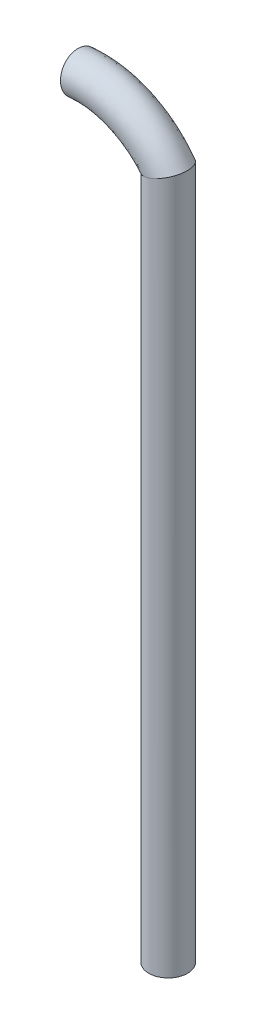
ISO-10303-21;
HEADER;
FILE_DESCRIPTION(('STEP AP214'),'2;1');
FILE_NAME('part.step','',(''),(''),'','','');
FILE_SCHEMA(('AUTOMOTIVE_DESIGN { 1 0 10303 214 1 1 1 1 }'));
ENDSEC;
DATA;
#1=APPLICATION_CONTEXT('core data for automotive mechanical design processes');
#2=APPLICATION_PROTOCOL_DEFINITION('international standard','automotive_design',2000,#1);
#3=PRODUCT_CONTEXT('',#1,'mechanical');
#4=PRODUCT('Part','Part','',(#3));
#5=PRODUCT_RELATED_PRODUCT_CATEGORY('part','',(#4));
#6=PRODUCT_DEFINITION_FORMATION('','',#4);
#7=PRODUCT_DEFINITION_CONTEXT('part definition',#1,'design');
#8=PRODUCT_DEFINITION('design','',#6,#7);
#9=PRODUCT_DEFINITION_SHAPE('','',#8);
#10=(LENGTH_UNIT() NAMED_UNIT(*) SI_UNIT(.MILLI.,.METRE.));
#11=(NAMED_UNIT(*) PLANE_ANGLE_UNIT() SI_UNIT($,.RADIAN.));
#12=(NAMED_UNIT(*) SI_UNIT($,.STERADIAN.) SOLID_ANGLE_UNIT());
#13=UNCERTAINTY_MEASURE_WITH_UNIT(LENGTH_MEASURE(1.E-05),#10,'distance_accuracy_value','');
#14=(GEOMETRIC_REPRESENTATION_CONTEXT(3) GLOBAL_UNCERTAINTY_ASSIGNED_CONTEXT((#13)) GLOBAL_UNIT_ASSIGNED_CONTEXT((#10,
#11,#12)) REPRESENTATION_CONTEXT('',''));
#15=CARTESIAN_POINT('',(0.,0.,0.));
#16=DIRECTION('',(0.,0.,1.));
#17=DIRECTION('',(1.,0.,0.));
#18=AXIS2_PLACEMENT_3D('',#15,#16,#17);
#19=CARTESIAN_POINT('',(0.,178.,0.));
#20=DIRECTION('',(0.,-1.,0.));
#21=DIRECTION('',(0.,0.,-1.));
#22=AXIS2_PLACEMENT_3D('',#19,#20,#21);
#23=CYLINDRICAL_SURFACE('',#22,5.);
#24=CARTESIAN_POINT('',(0.,0.,0.));
#25=DIRECTION('',(0.,1.,0.));
#26=DIRECTION('',(0.,0.,1.));
#27=AXIS2_PLACEMENT_3D('',#24,#25,#26);
#28=CIRCLE('',#27,5.);
#29=CARTESIAN_POINT('',(0.,0.,5.));
#30=VERTEX_POINT('',#29);
#31=EDGE_CURVE('E12',#30,#30,#28,.T.);
#32=ORIENTED_EDGE('',*,*,#31,.T.);
#33=EDGE_LOOP('',(#32));
#34=FACE_BOUND('',#33,.T.);
#35=CARTESIAN_POINT('',(0.,178.,5.00000000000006));
#36=CARTESIAN_POINT('',(-0.00574009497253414,177.998064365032,5.00000001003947));
#37=CARTESIAN_POINT('',(-0.011480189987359,177.996128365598,4.9999901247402));
#38=CARTESIAN_POINT('',(-0.164519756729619,177.944501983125,4.99946279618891));
#39=CARTESIAN_POINT('',(-0.311795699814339,177.89457968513,4.99244034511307));
#40=CARTESIAN_POINT('',(-0.605194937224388,177.794631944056,4.96542730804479));
#41=CARTESIAN_POINT('',(-0.751317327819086,177.74460645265,4.94542741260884));
#42=CARTESIAN_POINT('',(-1.04167101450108,177.644709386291,4.892519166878));
#43=CARTESIAN_POINT('',(-1.18589700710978,177.594838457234,4.8595803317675));
#44=CARTESIAN_POINT('',(-1.4711221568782,177.495721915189,4.78097199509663));
#45=CARTESIAN_POINT('',(-1.61212005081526,177.446476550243,4.7352975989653));
#46=CARTESIAN_POINT('',(-1.88973482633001,177.34903913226,4.63150614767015));
#47=CARTESIAN_POINT('',(-2.02635421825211,177.300846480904,4.57339637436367));
#48=CARTESIAN_POINT('',(-2.29433354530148,177.20586089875,4.44501020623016));
#49=CARTESIAN_POINT('',(-2.4256914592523,177.159068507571,4.37472919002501));
#50=CARTESIAN_POINT('',(-2.68196689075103,177.067350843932,4.22246955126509));
#51=CARTESIAN_POINT('',(-2.80688987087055,177.022423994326,4.14050108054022));
#52=CARTESIAN_POINT('',(-3.04940048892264,176.93481732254,3.96529087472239));
#53=CARTESIAN_POINT('',(-3.16698852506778,176.892137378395,3.87204975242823));
#54=CARTESIAN_POINT('',(-3.39137411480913,176.810348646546,3.6769826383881));
#55=CARTESIAN_POINT('',(-3.4983500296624,176.77118258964,3.57538591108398));
#56=CARTESIAN_POINT('',(-3.70333713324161,176.695842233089,3.36260385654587));
#57=CARTESIAN_POINT('',(-3.80135313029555,176.659666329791,3.25142373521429));
#58=CARTESIAN_POINT('',(-3.98760757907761,176.590680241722,3.02010646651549));
#59=CARTESIAN_POINT('',(-4.07584249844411,176.557871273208,2.89996610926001));
#60=CARTESIAN_POINT('',(-4.24157874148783,176.496050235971,2.65165562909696));
#61=CARTESIAN_POINT('',(-4.31908533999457,176.46703630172,2.5234894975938));
#62=CARTESIAN_POINT('',(-4.45849761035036,176.414706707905,2.26755532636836));
#63=CARTESIAN_POINT('',(-4.52104097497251,176.391160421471,2.14018155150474));
#64=CARTESIAN_POINT('',(-4.63525006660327,176.348070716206,1.88005903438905));
#65=CARTESIAN_POINT('',(-4.68692077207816,176.328525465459,1.7473127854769));
#66=CARTESIAN_POINT('',(-4.778868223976,176.293686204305,1.47741025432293));
#67=CARTESIAN_POINT('',(-4.81914674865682,176.278391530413,1.34025466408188));
#68=CARTESIAN_POINT('',(-4.88787692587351,176.252261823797,1.06259601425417));
#69=CARTESIAN_POINT('',(-4.91632911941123,176.241426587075,0.922093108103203));
#70=CARTESIAN_POINT('',(-4.95974251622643,176.224882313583,0.647391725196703));
#71=CARTESIAN_POINT('',(-4.9754106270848,176.218904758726,0.513320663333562));
#72=CARTESIAN_POINT('',(-4.99585761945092,176.211102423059,0.244181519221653));
#73=CARTESIAN_POINT('',(-5.0006328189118,176.209279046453,0.109113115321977));
#74=CARTESIAN_POINT('',(-4.99923316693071,176.209813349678,-0.160884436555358));
#75=CARTESIAN_POINT('',(-4.99306424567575,176.212168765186,-0.295813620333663));
#76=CARTESIAN_POINT('',(-4.96984746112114,176.221026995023,-0.564645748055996));
#77=CARTESIAN_POINT('',(-4.95279559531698,176.227531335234,-0.698548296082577));
#78=CARTESIAN_POINT('',(-4.90856984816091,176.24438120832,-0.9608141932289));
#79=CARTESIAN_POINT('',(-4.88167167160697,176.25462209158,-1.08923091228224));
#80=CARTESIAN_POINT('',(-4.81796451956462,176.278839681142,-1.34326939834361));
#81=CARTESIAN_POINT('',(-4.78115201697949,176.292817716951,-1.46889015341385));
#82=CARTESIAN_POINT('',(-4.69797273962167,176.324340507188,-1.71641891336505));
#83=CARTESIAN_POINT('',(-4.65160902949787,176.341884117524,-1.83832809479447));
#84=CARTESIAN_POINT('',(-4.54971362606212,176.380351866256,-2.07774920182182));
#85=CARTESIAN_POINT('',(-4.49417847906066,176.401277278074,-2.19525945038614));
#86=CARTESIAN_POINT('',(-4.37309893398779,176.44677937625,-2.42766160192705));
#87=CARTESIAN_POINT('',(-4.30736158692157,176.471426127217,-2.54243941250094));
#88=CARTESIAN_POINT('',(-4.16735940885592,176.523759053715,-2.76595997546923));
#89=CARTESIAN_POINT('',(-4.09309147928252,176.551446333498,-2.87470051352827));
#90=CARTESIAN_POINT('',(-3.85839266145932,176.638653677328,-3.19085615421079));
#91=CARTESIAN_POINT('',(-3.68595976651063,176.702359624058,-3.38840914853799));
#92=CARTESIAN_POINT('',(-3.30415770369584,176.842318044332,-3.76270762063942));
#93=CARTESIAN_POINT('',(-3.09328194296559,176.919066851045,-3.93771886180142));
#94=CARTESIAN_POINT('',(-2.64762581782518,177.079826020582,-4.25019772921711));
#95=CARTESIAN_POINT('',(-2.41282828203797,177.163841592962,-4.38763812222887));
#96=CARTESIAN_POINT('',(-1.9110050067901,177.341751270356,-4.62927532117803));
#97=CARTESIAN_POINT('',(-1.64289224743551,177.435935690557,-4.73099957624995));
#98=CARTESIAN_POINT('',(-1.09451636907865,177.626675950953,-4.88703527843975));
#99=CARTESIAN_POINT('',(-0.814274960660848,177.723227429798,-4.94142804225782));
#100=CARTESIAN_POINT('',(-0.36074963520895,177.877978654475,-4.98993209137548));
#101=CARTESIAN_POINT('',(-0.189013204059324,177.936239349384,-4.99937863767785));
#102=CARTESIAN_POINT('',(-0.0114802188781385,177.996128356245,-4.99999011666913));
#103=CARTESIAN_POINT('',(-0.00574012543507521,177.998064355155,-5.00000000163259));
#104=CARTESIAN_POINT('',(0.,177.999999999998,-5.));
#105=B_SPLINE_CURVE_WITH_KNOTS('',3,(#35,#36,#37,#38,#39,#40,#41,#42,#43,#44,#45,#46,#47,#48,
#49,#50,#51,#52,#53,#54,#55,#56,#57,#58,#59,#60,#61,#62,#63,#64,#65,#66,#67,#68,#69,#70,#71,#72,
#73,#74,#75,#76,#77,#78,#79,#80,#81,#82,#83,#84,#85,#86,#87,#88,#89,#90,#91,#92,#93,#94,#95,#96,
#97,#98,#99,#100,#101,#102,#103,#104),.UNSPECIFIED.,.F.,.F.,(4,2,2,2,2,2,2,2,2,2,2,2,2,2,2,2,2,
2,2,2,2,2,2,2,2,2,2,2,2,2,2,2,2,2,4),(0.,0.018173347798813,0.484531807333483,0.951225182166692,
1.41902477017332,1.88700439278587,2.354710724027,2.82259503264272,3.29007538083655,
3.75753032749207,4.21487606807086,4.67197491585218,5.12923830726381,5.58627606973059,
6.01724518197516,6.44801652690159,6.87872059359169,7.30940495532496,7.71425355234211,
8.11923897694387,8.52400502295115,8.92892001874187,9.32327025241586,9.71776096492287,
10.1121252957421,10.5066384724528,10.90981136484,11.3131311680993,12.1190776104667,
12.9692036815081,13.8199443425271,14.7214409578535,15.6213857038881,16.1652945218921,
16.183467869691),.UNSPECIFIED.);
#106=CARTESIAN_POINT('',(0.,178.,-5.));
#107=VERTEX_POINT('',#106);
#108=CARTESIAN_POINT('',(0.,178.,5.00000000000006));
#109=VERTEX_POINT('',#108);
#110=EDGE_CURVE('E58',#107,#109,#105,.F.);
#111=ORIENTED_EDGE('',*,*,#110,.F.);
#112=CARTESIAN_POINT('',(0.,178.,5.00000000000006));
#113=CARTESIAN_POINT('',(0.00574009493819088,178.001935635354,5.00000000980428));
#114=CARTESIAN_POINT('',(0.0114803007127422,178.003871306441,4.99999012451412));
#115=CARTESIAN_POINT('',(0.163474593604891,178.055125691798,4.99946639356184));
#116=CARTESIAN_POINT('',(0.309777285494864,178.104459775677,4.99253958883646));
#117=CARTESIAN_POINT('',(0.60139720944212,178.20279584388,4.96586194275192));
#118=CARTESIAN_POINT('',(0.746713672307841,178.251797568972,4.94610204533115));
#119=CARTESIAN_POINT('',(1.03562296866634,178.349219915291,4.89377987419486));
#120=CARTESIAN_POINT('',(1.17921099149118,178.397638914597,4.86118784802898));
#121=CARTESIAN_POINT('',(1.46332982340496,178.493445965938,4.78334314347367));
#122=CARTESIAN_POINT('',(1.60385945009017,178.540833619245,4.73808565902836));
#123=CARTESIAN_POINT('',(1.8807433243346,178.634200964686,4.63514982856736));
#124=CARTESIAN_POINT('',(2.017098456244,178.680180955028,4.57747413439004));
#125=CARTESIAN_POINT('',(2.28467465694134,178.770409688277,4.44997002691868));
#126=CARTESIAN_POINT('',(2.41589375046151,178.814657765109,4.38013699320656));
#127=CARTESIAN_POINT('',(2.67198309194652,178.901013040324,4.2287833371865));
#128=CARTESIAN_POINT('',(2.79685893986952,178.943122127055,4.14727327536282));
#129=CARTESIAN_POINT('',(3.03934283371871,179.024889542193,3.97299450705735));
#130=CARTESIAN_POINT('',(3.15695128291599,179.064548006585,3.88022642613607));
#131=CARTESIAN_POINT('',(3.3808135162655,179.140036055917,3.68665191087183));
#132=CARTESIAN_POINT('',(3.48728799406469,179.175940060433,3.58612976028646));
#133=CARTESIAN_POINT('',(3.69140360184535,179.244769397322,3.37565068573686));
#134=CARTESIAN_POINT('',(3.78904942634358,179.277696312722,3.26569883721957));
#135=CARTESIAN_POINT('',(3.97470749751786,179.340301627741,3.03700521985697));
#136=CARTESIAN_POINT('',(4.06271615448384,179.369978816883,2.91826020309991));
#137=CARTESIAN_POINT('',(4.2281691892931,179.425770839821,2.67291321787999));
#138=CARTESIAN_POINT('',(4.30561853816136,179.451887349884,2.54631498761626));
#139=CARTESIAN_POINT('',(4.44547294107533,179.499047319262,2.29294710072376));
#140=CARTESIAN_POINT('',(4.50845139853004,179.520284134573,2.16652967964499));
#141=CARTESIAN_POINT('',(4.62363132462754,179.559123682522,1.9084016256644));
#142=CARTESIAN_POINT('',(4.67583751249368,179.576728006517,1.77669334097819));
#143=CARTESIAN_POINT('',(4.76898820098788,179.608139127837,1.5089218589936));
#144=CARTESIAN_POINT('',(4.80993348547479,179.621946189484,1.37285896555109));
#145=CARTESIAN_POINT('',(4.88015057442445,179.645623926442,1.097418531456));
#146=CARTESIAN_POINT('',(4.90942274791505,179.655494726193,0.958041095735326));
#147=CARTESIAN_POINT('',(4.95489970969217,179.670829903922,0.683661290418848));
#148=CARTESIAN_POINT('',(4.9716523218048,179.676479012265,0.548759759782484));
#149=CARTESIAN_POINT('',(4.99412179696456,179.684055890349,0.277887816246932));
#150=CARTESIAN_POINT('',(4.99983489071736,179.685982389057,0.1419170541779));
#151=CARTESIAN_POINT('',(5.00015797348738,179.686091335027,-0.129970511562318));
#152=CARTESIAN_POINT('',(4.99477350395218,179.684275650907,-0.265887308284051));
#153=CARTESIAN_POINT('',(4.97296063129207,179.676920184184,-0.536780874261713));
#154=CARTESIAN_POINT('',(4.95652816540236,179.671379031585,-0.671757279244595));
#155=CARTESIAN_POINT('',(4.91319947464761,179.6567682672,-0.937119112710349));
#156=CARTESIAN_POINT('',(4.88651302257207,179.647769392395,-1.06754277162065));
#157=CARTESIAN_POINT('',(4.82290173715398,179.626319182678,-1.32562772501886));
#158=CARTESIAN_POINT('',(4.7859732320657,179.613866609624,-1.45328801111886));
#159=CARTESIAN_POINT('',(4.70222606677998,179.58562642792,-1.70488773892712));
#160=CARTESIAN_POINT('',(4.65541106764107,179.569840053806,-1.82882853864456));
#161=CARTESIAN_POINT('',(4.55227118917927,179.535060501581,-2.07227226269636));
#162=CARTESIAN_POINT('',(4.49594273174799,179.516066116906,-2.19177349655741));
#163=CARTESIAN_POINT('',(4.37333328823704,179.474721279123,-2.42731154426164));
#164=CARTESIAN_POINT('',(4.30691481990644,179.452324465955,-2.5432687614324));
#165=CARTESIAN_POINT('',(4.16532537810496,179.404579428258,-2.7690890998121));
#166=CARTESIAN_POINT('',(4.09015128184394,179.3792301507,-2.87895002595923));
#167=CARTESIAN_POINT('',(3.85240134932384,179.299059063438,-3.19832889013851));
#168=CARTESIAN_POINT('',(3.67749812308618,179.240080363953,-3.3978332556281));
#169=CARTESIAN_POINT('',(3.28188803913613,179.10667763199,-3.78322635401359));
#170=CARTESIAN_POINT('',(3.05837927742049,179.031308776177,-3.96589674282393));
#171=CARTESIAN_POINT('',(2.58539990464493,178.87181653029,-4.28926870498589));
#172=CARTESIAN_POINT('',(2.33590928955,178.787686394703,-4.42993761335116));
#173=CARTESIAN_POINT('',(1.81847533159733,178.613203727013,-4.66627525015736));
#174=CARTESIAN_POINT('',(1.55052670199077,178.52284941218,-4.76193102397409));
#175=CARTESIAN_POINT('',(1.00398501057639,178.338551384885,-4.90628859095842));
#176=CARTESIAN_POINT('',(0.725414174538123,178.244615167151,-4.95508337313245));
#177=CARTESIAN_POINT('',(0.302803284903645,178.102108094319,-4.99287343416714));
#178=CARTESIAN_POINT('',(0.160007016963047,178.053956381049,-4.99947868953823));
#179=CARTESIAN_POINT('',(0.011480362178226,178.00387132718,-4.99999011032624));
#180=CARTESIAN_POINT('',(0.00574015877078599,178.001935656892,-4.99999999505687));
#181=CARTESIAN_POINT('',(0.,177.999999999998,-5.));
#182=B_SPLINE_CURVE_WITH_KNOTS('',3,(#112,#113,#114,#115,#116,#117,#118,#119,#120,#121,#122,
#123,#124,#125,#126,#127,#128,#129,#130,#131,#132,#133,#134,#135,#136,#137,#138,#139,#140,#141,
#142,#143,#144,#145,#146,#147,#148,#149,#150,#151,#152,#153,#154,#155,#156,#157,#158,#159,#160,
#161,#162,#163,#164,#165,#166,#167,#168,#169,#170,#171,#172,#173,#174,#175,#176,#177,#178,#179,
#180,#181),.UNSPECIFIED.,.F.,.F.,(4,2,2,2,2,2,2,2,2,2,2,2,2,2,2,2,2,2,2,2,2,2,2,2,2,2,2,2,2,2,2,
2,2,2,4),(0.,0.0181733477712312,0.481203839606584,0.944561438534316,1.4089997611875,
1.87361455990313,2.33813024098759,2.80282284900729,3.26709782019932,3.73134700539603,
4.18307497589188,4.63456131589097,5.08621526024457,5.53765583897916,5.9655876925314,
6.39333167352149,6.82104587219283,7.24874654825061,7.65641495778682,8.06422253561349,
8.47182652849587,8.87958049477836,9.27940231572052,9.67936765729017,10.0791851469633,
10.4791533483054,10.8851631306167,11.2913181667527,12.1029834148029,12.9936976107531,
13.8851027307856,14.7767642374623,15.6666526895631,16.118709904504,16.1368832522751),.UNSPECIFIED.);
#183=EDGE_CURVE('E63',#107,#109,#182,.F.);
#184=ORIENTED_EDGE('',*,*,#183,.T.);
#185=EDGE_LOOP('',(#111,#184));
#186=FACE_BOUND('',#185,.T.);
#187=ADVANCED_FACE('F50',(#34,#186),#23,.T.);
#188=CARTESIAN_POINT('',(0.,0.,0.));
#189=DIRECTION('',(0.,1.,0.));
#190=DIRECTION('',(0.,0.,1.));
#191=AXIS2_PLACEMENT_3D('',#188,#189,#190);
#192=PLANE('',#191);
#193=CARTESIAN_POINT('',(0.,0.,0.));
#194=DIRECTION('',(0.,-1.,0.));
#195=DIRECTION('',(0.,0.,-1.));
#196=AXIS2_PLACEMENT_3D('',#193,#194,#195);
#197=CIRCLE('',#196,3.);
#198=CARTESIAN_POINT('',(0.,0.,-3.));
#199=VERTEX_POINT('',#198);
#200=EDGE_CURVE('E69',#199,#199,#197,.T.);
#201=ORIENTED_EDGE('',*,*,#200,.F.);
#202=EDGE_LOOP('',(#201));
#203=FACE_BOUND('',#202,.T.);
#204=ORIENTED_EDGE('',*,*,#31,.F.);
#205=EDGE_LOOP('',(#204));
#206=FACE_BOUND('',#205,.T.);
#207=ADVANCED_FACE('F114',(#203,#206),#192,.F.);
#208=CARTESIAN_POINT('',(0.,40.,0.));
#209=DIRECTION('',(0.,-1.,0.));
#210=DIRECTION('',(0.,0.,-1.));
#211=AXIS2_PLACEMENT_3D('',#208,#209,#210);
#212=CYLINDRICAL_SURFACE('',#211,3.);
#213=CARTESIAN_POINT('',(0.,40.,0.));
#214=DIRECTION('',(0.,-1.,0.));
#215=DIRECTION('',(0.,0.,-1.));
#216=AXIS2_PLACEMENT_3D('',#213,#214,#215);
#217=CIRCLE('',#216,3.);
#218=CARTESIAN_POINT('',(0.,40.,-3.));
#219=VERTEX_POINT('',#218);
#220=EDGE_CURVE('E53',#219,#219,#217,.T.);
#221=ORIENTED_EDGE('',*,*,#220,.F.);
#222=EDGE_LOOP('',(#221));
#223=FACE_BOUND('',#222,.T.);
#224=ORIENTED_EDGE('',*,*,#200,.T.);
#225=EDGE_LOOP('',(#224));
#226=FACE_BOUND('',#225,.T.);
#227=ADVANCED_FACE('F109',(#223,#226),#212,.F.);
#228=CARTESIAN_POINT('',(0.,40.,0.));
#229=DIRECTION('',(0.,-1.,0.));
#230=DIRECTION('',(0.,0.,-1.));
#231=AXIS2_PLACEMENT_3D('',#228,#229,#230);
#232=PLANE('',#231);
#233=ORIENTED_EDGE('',*,*,#220,.T.);
#234=EDGE_LOOP('',(#233));
#235=FACE_BOUND('',#234,.T.);
#236=ADVANCED_FACE('F97',(#235),#232,.T.);
#237=CARTESIAN_POINT('',(-22.8176418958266,187.858152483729,0.));
#238=DIRECTION('',(-0.994524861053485,-0.104500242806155,0.));
#239=DIRECTION('',(0.,0.,1.));
#240=AXIS2_PLACEMENT_3D('',#237,#238,#239);
#241=PLANE('',#240);
#242=CARTESIAN_POINT('',(-22.8176418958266,187.858152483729,0.));
#243=DIRECTION('',(-0.994524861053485,-0.104500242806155,0.));
#244=DIRECTION('',(0.,0.,1.));
#245=AXIS2_PLACEMENT_3D('',#242,#243,#244);
#246=CIRCLE('',#245,5.);
#247=CARTESIAN_POINT('',(-22.8176418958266,187.858152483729,5.));
#248=VERTEX_POINT('',#247);
#249=EDGE_CURVE('E67',#248,#248,#246,.T.);
#250=ORIENTED_EDGE('',*,*,#249,.T.);
#251=EDGE_LOOP('',(#250));
#252=FACE_BOUND('',#251,.T.);
#253=ADVANCED_FACE('F98',(#252),#241,.T.);
#254=CARTESIAN_POINT('',(2.30674172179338,174.96856712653,5.));
#255=CARTESIAN_POINT('',(1.92228476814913,175.473805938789,5.));
#256=CARTESIAN_POINT('',(1.53782781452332,175.979044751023,5.));
#257=CARTESIAN_POINT('',(0.961142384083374,176.736902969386,5.));
#258=CARTESIAN_POINT('',(0.768913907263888,176.989522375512,5.));
#259=CARTESIAN_POINT('',(0.480571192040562,177.368451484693,5.));
#260=CARTESIAN_POINT('',(0.384456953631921,177.494761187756,5.));
#261=CARTESIAN_POINT('',(0.240285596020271,177.684225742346,5.));
#262=CARTESIAN_POINT('',(0.192228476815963,177.747380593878,5.));
#263=CARTESIAN_POINT('',(0.0961142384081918,177.873690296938,5.));
#264=CARTESIAN_POINT('',(0.0480577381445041,177.936845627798,5.));
#265=CARTESIAN_POINT('',(-0.0409893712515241,178.05386558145,5.));
#266=CARTESIAN_POINT('',(-0.0821920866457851,178.107565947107,5.));
#267=CARTESIAN_POINT('',(-0.165024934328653,178.214630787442,5.));
#268=CARTESIAN_POINT('',(-0.206654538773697,178.267995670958,5.));
#269=CARTESIAN_POINT('',(-0.332179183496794,178.427583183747,5.));
#270=CARTESIAN_POINT('',(-0.41671007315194,178.533298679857,5.));
#271=CARTESIAN_POINT('',(-0.672815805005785,178.848380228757,5.));
#272=CARTESIAN_POINT('',(-0.846904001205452,179.055681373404,5.));
#273=CARTESIAN_POINT('',(-1.37896883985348,179.669032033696,5.));
#274=CARTESIAN_POINT('',(-1.74675036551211,180.066528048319,5.));
#275=CARTESIAN_POINT('',(-2.88711956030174,181.222459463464,5.));
#276=CARTESIAN_POINT('',(-3.69679248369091,181.94429160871,5.));
#277=CARTESIAN_POINT('',(-6.25410680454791,183.945651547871,5.));
#278=CARTESIAN_POINT('',(-8.12998959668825,185.059757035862,5.));
#279=CARTESIAN_POINT('',(-14.0919966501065,187.635587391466,5.));
#280=CARTESIAN_POINT('',(-18.5093449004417,188.310849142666,5.));
#281=CARTESIAN_POINT('',(-22.8176418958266,187.858152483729,5.));
#282=CARTESIAN_POINT('',(10.2647545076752,181.024145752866,5.));
#283=CARTESIAN_POINT('',(9.88029755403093,181.529384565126,5.));
#284=CARTESIAN_POINT('',(9.49584060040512,182.03462337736,5.));
#285=CARTESIAN_POINT('',(8.91915516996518,182.792481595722,5.));
#286=CARTESIAN_POINT('',(8.72692669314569,183.045101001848,5.));
#287=CARTESIAN_POINT('',(8.43858397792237,183.424030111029,5.));
#288=CARTESIAN_POINT('',(8.34246973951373,183.550339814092,5.));
#289=CARTESIAN_POINT('',(8.19829838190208,183.739804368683,5.));
#290=CARTESIAN_POINT('',(8.15024126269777,183.802959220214,5.));
#291=CARTESIAN_POINT('',(8.05412702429,183.929268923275,5.));
#292=CARTESIAN_POINT('',(8.01555156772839,183.979965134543,5.));
#293=CARTESIAN_POINT('',(7.90893684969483,184.120070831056,5.));
#294=CARTESIAN_POINT('',(7.84339067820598,184.205586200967,5.));
#295=CARTESIAN_POINT('',(7.72787498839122,184.35489495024,5.));
#296=CARTESIAN_POINT('',(7.66981984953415,184.429315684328,5.));
#297=CARTESIAN_POINT('',(7.49476772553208,184.651870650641,5.));
#298=CARTESIAN_POINT('',(7.37688400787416,184.799297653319,5.));
#299=CARTESIAN_POINT('',(7.01972822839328,185.238698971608,5.));
#300=CARTESIAN_POINT('',(6.77695113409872,185.527793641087,5.));
#301=CARTESIAN_POINT('',(6.03495277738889,186.383150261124,5.));
#302=CARTESIAN_POINT('',(5.52205797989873,186.937483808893,5.));
#303=CARTESIAN_POINT('',(3.93174039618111,188.549503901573,5.));
#304=CARTESIAN_POINT('',(2.80259985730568,189.556144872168,5.));
#305=CARTESIAN_POINT('',(-0.763738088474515,192.347168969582,5.));
#306=CARTESIAN_POINT('',(-3.37977630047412,193.900860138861,5.));
#307=CARTESIAN_POINT('',(-11.6941754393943,197.493019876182,5.));
#308=CARTESIAN_POINT('',(-17.8544493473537,198.434715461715,5.));
#309=CARTESIAN_POINT('',(-23.8626443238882,197.803401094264,5.));
#310=CARTESIAN_POINT('',(10.2647545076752,181.024145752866,-5.));
#311=CARTESIAN_POINT('',(9.88029755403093,181.529384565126,-5.));
#312=CARTESIAN_POINT('',(9.49584060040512,182.03462337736,-5.));
#313=CARTESIAN_POINT('',(8.91915516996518,182.792481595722,-5.));
#314=CARTESIAN_POINT('',(8.72692669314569,183.045101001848,-5.));
#315=CARTESIAN_POINT('',(8.43858397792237,183.424030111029,-5.));
#316=CARTESIAN_POINT('',(8.34246973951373,183.550339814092,-5.));
#317=CARTESIAN_POINT('',(8.19829838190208,183.739804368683,-5.));
#318=CARTESIAN_POINT('',(8.15024126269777,183.802959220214,-5.));
#319=CARTESIAN_POINT('',(8.05412702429,183.929268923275,-5.));
#320=CARTESIAN_POINT('',(8.01555156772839,183.979965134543,-5.));
#321=CARTESIAN_POINT('',(7.90893684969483,184.120070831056,-5.));
#322=CARTESIAN_POINT('',(7.84339067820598,184.205586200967,-5.));
#323=CARTESIAN_POINT('',(7.72787498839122,184.35489495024,-5.));
#324=CARTESIAN_POINT('',(7.66981984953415,184.429315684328,-5.));
#325=CARTESIAN_POINT('',(7.49476772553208,184.651870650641,-5.));
#326=CARTESIAN_POINT('',(7.37688400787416,184.799297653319,-5.));
#327=CARTESIAN_POINT('',(7.01972822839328,185.238698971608,-5.));
#328=CARTESIAN_POINT('',(6.77695113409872,185.527793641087,-5.));
#329=CARTESIAN_POINT('',(6.03495277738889,186.383150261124,-5.));
#330=CARTESIAN_POINT('',(5.52205797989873,186.937483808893,-5.));
#331=CARTESIAN_POINT('',(3.93174039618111,188.549503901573,-5.));
#332=CARTESIAN_POINT('',(2.80259985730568,189.556144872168,-5.));
#333=CARTESIAN_POINT('',(-0.763738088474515,192.347168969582,-5.));
#334=CARTESIAN_POINT('',(-3.37977630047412,193.900860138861,-5.));
#335=CARTESIAN_POINT('',(-11.6941754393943,197.493019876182,-5.));
#336=CARTESIAN_POINT('',(-17.8544493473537,198.434715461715,-5.));
#337=CARTESIAN_POINT('',(-23.8626443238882,197.803401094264,-5.));
#338=CARTESIAN_POINT('',(2.30674172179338,174.96856712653,-5.));
#339=CARTESIAN_POINT('',(1.92228476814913,175.473805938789,-5.));
#340=CARTESIAN_POINT('',(1.53782781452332,175.979044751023,-5.));
#341=CARTESIAN_POINT('',(0.961142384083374,176.736902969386,-5.));
#342=CARTESIAN_POINT('',(0.768913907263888,176.989522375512,-5.));
#343=CARTESIAN_POINT('',(0.480571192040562,177.368451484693,-5.));
#344=CARTESIAN_POINT('',(0.384456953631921,177.494761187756,-5.));
#345=CARTESIAN_POINT('',(0.240285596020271,177.684225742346,-5.));
#346=CARTESIAN_POINT('',(0.192228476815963,177.747380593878,-5.));
#347=CARTESIAN_POINT('',(0.0961142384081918,177.873690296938,-5.));
#348=CARTESIAN_POINT('',(0.0480577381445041,177.936845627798,-5.));
#349=CARTESIAN_POINT('',(-0.0409893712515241,178.05386558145,-5.));
#350=CARTESIAN_POINT('',(-0.0821920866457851,178.107565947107,-5.));
#351=CARTESIAN_POINT('',(-0.165024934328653,178.214630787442,-5.));
#352=CARTESIAN_POINT('',(-0.206654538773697,178.267995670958,-5.));
#353=CARTESIAN_POINT('',(-0.332179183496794,178.427583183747,-5.));
#354=CARTESIAN_POINT('',(-0.41671007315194,178.533298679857,-5.));
#355=CARTESIAN_POINT('',(-0.672815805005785,178.848380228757,-5.));
#356=CARTESIAN_POINT('',(-0.846904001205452,179.055681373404,-5.));
#357=CARTESIAN_POINT('',(-1.37896883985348,179.669032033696,-5.));
#358=CARTESIAN_POINT('',(-1.74675036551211,180.066528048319,-5.));
#359=CARTESIAN_POINT('',(-2.88711956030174,181.222459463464,-5.));
#360=CARTESIAN_POINT('',(-3.69679248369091,181.94429160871,-5.));
#361=CARTESIAN_POINT('',(-6.25410680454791,183.945651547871,-5.));
#362=CARTESIAN_POINT('',(-8.12998959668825,185.059757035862,-5.));
#363=CARTESIAN_POINT('',(-14.0919966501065,187.635587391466,-5.));
#364=CARTESIAN_POINT('',(-18.5093449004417,188.310849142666,-5.));
#365=CARTESIAN_POINT('',(-22.8176418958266,187.858152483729,-5.));
#366=CARTESIAN_POINT('',(-5.65127106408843,168.912988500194,-5.));
#367=CARTESIAN_POINT('',(-6.03572801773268,169.418227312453,-5.));
#368=CARTESIAN_POINT('',(-6.42018497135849,169.923466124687,-5.));
#369=CARTESIAN_POINT('',(-6.99687040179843,170.681324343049,-5.));
#370=CARTESIAN_POINT('',(-7.18909887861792,170.933943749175,-5.));
#371=CARTESIAN_POINT('',(-7.47744159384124,171.312872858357,-5.));
#372=CARTESIAN_POINT('',(-7.57355583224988,171.439182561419,-5.));
#373=CARTESIAN_POINT('',(-7.71772718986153,171.62864711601,-5.));
#374=CARTESIAN_POINT('',(-7.76578430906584,171.691801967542,-5.));
#375=CARTESIAN_POINT('',(-7.86189854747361,171.818111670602,-5.));
#376=CARTESIAN_POINT('',(-7.91943609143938,171.893726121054,-5.));
#377=CARTESIAN_POINT('',(-7.99091559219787,171.987660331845,-5.));
#378=CARTESIAN_POINT('',(-8.00777485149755,172.009545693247,-5.));
#379=CARTESIAN_POINT('',(-8.05792485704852,172.074366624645,-5.));
#380=CARTESIAN_POINT('',(-8.08312892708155,172.106675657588,-5.));
#381=CARTESIAN_POINT('',(-8.15912609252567,172.203295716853,-5.));
#382=CARTESIAN_POINT('',(-8.21030415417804,172.267299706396,-5.));
#383=CARTESIAN_POINT('',(-8.36535983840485,172.458061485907,-5.));
#384=CARTESIAN_POINT('',(-8.47075913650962,172.58356910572,-5.));
#385=CARTESIAN_POINT('',(-8.79289045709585,172.954913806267,-5.));
#386=CARTESIAN_POINT('',(-9.01555871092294,173.195572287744,-5.));
#387=CARTESIAN_POINT('',(-9.70597951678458,173.895415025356,-5.));
#388=CARTESIAN_POINT('',(-10.1961848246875,174.332438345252,-5.));
#389=CARTESIAN_POINT('',(-11.7444755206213,175.544134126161,-5.));
#390=CARTESIAN_POINT('',(-12.8802028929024,176.218653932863,-5.));
#391=CARTESIAN_POINT('',(-16.4898178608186,177.77815490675,-5.));
#392=CARTESIAN_POINT('',(-19.1642404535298,178.186982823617,-5.));
#393=CARTESIAN_POINT('',(-21.7726394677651,177.912903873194,-5.));
#394=CARTESIAN_POINT('',(-5.65127106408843,168.912988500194,5.));
#395=CARTESIAN_POINT('',(-6.03572801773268,169.418227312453,5.));
#396=CARTESIAN_POINT('',(-6.42018497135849,169.923466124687,5.));
#397=CARTESIAN_POINT('',(-6.99687040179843,170.681324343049,5.));
#398=CARTESIAN_POINT('',(-7.18909887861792,170.933943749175,5.));
#399=CARTESIAN_POINT('',(-7.47744159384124,171.312872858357,5.));
#400=CARTESIAN_POINT('',(-7.57355583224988,171.439182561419,5.));
#401=CARTESIAN_POINT('',(-7.71772718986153,171.62864711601,5.));
#402=CARTESIAN_POINT('',(-7.76578430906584,171.691801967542,5.));
#403=CARTESIAN_POINT('',(-7.86189854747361,171.818111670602,5.));
#404=CARTESIAN_POINT('',(-7.91943609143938,171.893726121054,5.));
#405=CARTESIAN_POINT('',(-7.99091559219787,171.987660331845,5.));
#406=CARTESIAN_POINT('',(-8.00777485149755,172.009545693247,5.));
#407=CARTESIAN_POINT('',(-8.05792485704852,172.074366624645,5.));
#408=CARTESIAN_POINT('',(-8.08312892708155,172.106675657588,5.));
#409=CARTESIAN_POINT('',(-8.15912609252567,172.203295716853,5.));
#410=CARTESIAN_POINT('',(-8.21030415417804,172.267299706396,5.));
#411=CARTESIAN_POINT('',(-8.36535983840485,172.458061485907,5.));
#412=CARTESIAN_POINT('',(-8.47075913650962,172.58356910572,5.));
#413=CARTESIAN_POINT('',(-8.79289045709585,172.954913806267,5.));
#414=CARTESIAN_POINT('',(-9.01555871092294,173.195572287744,5.));
#415=CARTESIAN_POINT('',(-9.70597951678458,173.895415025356,5.));
#416=CARTESIAN_POINT('',(-10.1961848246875,174.332438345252,5.));
#417=CARTESIAN_POINT('',(-11.7444755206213,175.544134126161,5.));
#418=CARTESIAN_POINT('',(-12.8802028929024,176.218653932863,5.));
#419=CARTESIAN_POINT('',(-16.4898178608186,177.77815490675,5.));
#420=CARTESIAN_POINT('',(-19.1642404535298,178.186982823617,5.));
#421=CARTESIAN_POINT('',(-21.7726394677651,177.912903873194,5.));
#422=CARTESIAN_POINT('',(2.30674172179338,174.96856712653,5.));
#423=CARTESIAN_POINT('',(1.92228476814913,175.473805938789,5.));
#424=CARTESIAN_POINT('',(1.53782781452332,175.979044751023,5.));
#425=CARTESIAN_POINT('',(0.961142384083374,176.736902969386,5.));
#426=CARTESIAN_POINT('',(0.768913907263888,176.989522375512,5.));
#427=CARTESIAN_POINT('',(0.480571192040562,177.368451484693,5.));
#428=CARTESIAN_POINT('',(0.384456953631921,177.494761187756,5.));
#429=CARTESIAN_POINT('',(0.240285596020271,177.684225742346,5.));
#430=CARTESIAN_POINT('',(0.192228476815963,177.747380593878,5.));
#431=CARTESIAN_POINT('',(0.0961142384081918,177.873690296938,5.));
#432=CARTESIAN_POINT('',(0.0480577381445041,177.936845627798,5.));
#433=CARTESIAN_POINT('',(-0.0409893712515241,178.05386558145,5.));
#434=CARTESIAN_POINT('',(-0.0821920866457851,178.107565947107,5.));
#435=CARTESIAN_POINT('',(-0.165024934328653,178.214630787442,5.));
#436=CARTESIAN_POINT('',(-0.206654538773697,178.267995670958,5.));
#437=CARTESIAN_POINT('',(-0.332179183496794,178.427583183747,5.));
#438=CARTESIAN_POINT('',(-0.41671007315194,178.533298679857,5.));
#439=CARTESIAN_POINT('',(-0.672815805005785,178.848380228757,5.));
#440=CARTESIAN_POINT('',(-0.846904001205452,179.055681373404,5.));
#441=CARTESIAN_POINT('',(-1.37896883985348,179.669032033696,5.));
#442=CARTESIAN_POINT('',(-1.74675036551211,180.066528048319,5.));
#443=CARTESIAN_POINT('',(-2.88711956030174,181.222459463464,5.));
#444=CARTESIAN_POINT('',(-3.69679248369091,181.94429160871,5.));
#445=CARTESIAN_POINT('',(-6.25410680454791,183.945651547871,5.));
#446=CARTESIAN_POINT('',(-8.12998959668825,185.059757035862,5.));
#447=CARTESIAN_POINT('',(-14.0919966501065,187.635587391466,5.));
#448=CARTESIAN_POINT('',(-18.5093449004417,188.310849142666,5.));
#449=CARTESIAN_POINT('',(-22.8176418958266,187.858152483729,5.));
#450=(BOUNDED_SURFACE() B_SPLINE_SURFACE(3,3,((#254,#255,#256,#257,#258,#259,#260,#261,#262,
#263,#264,#265,#266,#267,#268,#269,#270,#271,#272,#273,#274,#275,#276,#277,#278,#279,#280,#281),
(#282,#283,#284,#285,#286,#287,#288,#289,#290,#291,#292,#293,#294,#295,#296,#297,#298,#299,#300,
#301,#302,#303,#304,#305,#306,#307,#308,#309),(#310,#311,#312,#313,#314,#315,#316,#317,#318,
#319,#320,#321,#322,#323,#324,#325,#326,#327,#328,#329,#330,#331,#332,#333,#334,#335,#336,#337),
(#338,#339,#340,#341,#342,#343,#344,#345,#346,#347,#348,#349,#350,#351,#352,#353,#354,#355,#356,
#357,#358,#359,#360,#361,#362,#363,#364,#365),(#366,#367,#368,#369,#370,#371,#372,#373,#374,
#375,#376,#377,#378,#379,#380,#381,#382,#383,#384,#385,#386,#387,#388,#389,#390,#391,#392,#393),
(#394,#395,#396,#397,#398,#399,#400,#401,#402,#403,#404,#405,#406,#407,#408,#409,#410,#411,#412,
#413,#414,#415,#416,#417,#418,#419,#420,#421),(#422,#423,#424,#425,#426,#427,#428,#429,#430,
#431,#432,#433,#434,#435,#436,#437,#438,#439,#440,#441,#442,#443,#444,#445,#446,#447,#448,
#449)),.UNSPECIFIED.,.T.,.F.,.F.) B_SPLINE_SURFACE_WITH_KNOTS((4,3,4),(4,2,2,2,2,2,2,2,2,2,2,2,
2,4),(0.,0.5,1.),(-0.146555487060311,-0.0732777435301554,-0.0366388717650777,
-0.0183194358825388,-0.00915971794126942,0.,0.0078125,0.015625,0.03125,0.0625,0.125,0.25,0.5,
1.),.UNSPECIFIED.) GEOMETRIC_REPRESENTATION_ITEM() RATIONAL_B_SPLINE_SURFACE(((1.,1.,1.,1.,1.,
1.,1.,1.,1.,1.,1.,1.,1.,1.,1.,1.,1.,1.,1.,1.,1.,1.,1.,1.,1.,1.,1.,1.),(0.333333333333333,
0.333333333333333,0.333333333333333,0.333333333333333,0.333333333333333,0.333333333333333,
0.333333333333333,0.333333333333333,0.333333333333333,0.333333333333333,0.333333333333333,
0.333333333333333,0.333333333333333,0.333333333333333,0.333333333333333,0.333333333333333,
0.333333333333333,0.333333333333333,0.333333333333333,0.333333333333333,0.333333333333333,
0.333333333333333,0.333333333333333,0.333333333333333,0.333333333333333,0.333333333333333,
0.333333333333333,0.333333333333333),(0.333333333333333,0.333333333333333,0.333333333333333,
0.333333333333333,0.333333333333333,0.333333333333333,0.333333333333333,0.333333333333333,
0.333333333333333,0.333333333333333,0.333333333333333,0.333333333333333,0.333333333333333,
0.333333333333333,0.333333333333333,0.333333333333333,0.333333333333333,0.333333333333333,
0.333333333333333,0.333333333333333,0.333333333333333,0.333333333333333,0.333333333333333,
0.333333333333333,0.333333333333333,0.333333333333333,0.333333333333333,0.333333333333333),(1.,
1.,1.,1.,1.,1.,1.,1.,1.,1.,1.,1.,1.,1.,1.,1.,1.,1.,1.,1.,1.,1.,1.,1.,1.,1.,1.,1.),
(0.333333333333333,0.333333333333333,0.333333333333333,0.333333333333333,0.333333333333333,
0.333333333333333,0.333333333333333,0.333333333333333,0.333333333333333,0.333333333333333,
0.333333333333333,0.333333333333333,0.333333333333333,0.333333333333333,0.333333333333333,
0.333333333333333,0.333333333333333,0.333333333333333,0.333333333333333,0.333333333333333,
0.333333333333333,0.333333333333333,0.333333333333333,0.333333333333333,0.333333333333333,
0.333333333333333,0.333333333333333,0.333333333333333),(0.333333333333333,0.333333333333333,
0.333333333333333,0.333333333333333,0.333333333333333,0.333333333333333,0.333333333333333,
0.333333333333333,0.333333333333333,0.333333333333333,0.333333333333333,0.333333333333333,
0.333333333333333,0.333333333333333,0.333333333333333,0.333333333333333,0.333333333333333,
0.333333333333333,0.333333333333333,0.333333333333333,0.333333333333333,0.333333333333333,
0.333333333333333,0.333333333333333,0.333333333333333,0.333333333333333,0.333333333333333,
0.333333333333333),(1.,1.,1.,1.,1.,1.,1.,1.,1.,1.,1.,1.,1.,1.,1.,1.,1.,1.,1.,1.,1.,1.,1.,1.,1.,
1.,1.,1.))) REPRESENTATION_ITEM('') SURFACE());
#451=ORIENTED_EDGE('',*,*,#183,.F.);
#452=ORIENTED_EDGE('',*,*,#110,.T.);
#453=EDGE_LOOP('',(#451,#452));
#454=FACE_BOUND('',#453,.T.);
#455=ORIENTED_EDGE('',*,*,#249,.F.);
#456=EDGE_LOOP('',(#455));
#457=FACE_BOUND('',#456,.T.);
#458=ADVANCED_FACE('F64',(#454,#457),#450,.T.);
#459=CLOSED_SHELL('',(#187,#207,#227,#236,#253,#458));
#460=MANIFOLD_SOLID_BREP('B2',#459);
#461=ADVANCED_BREP_SHAPE_REPRESENTATION('',(#18,#460),#14);
#462=SHAPE_DEFINITION_REPRESENTATION(#9,#461);
ENDSEC;
END-ISO-10303-21;
